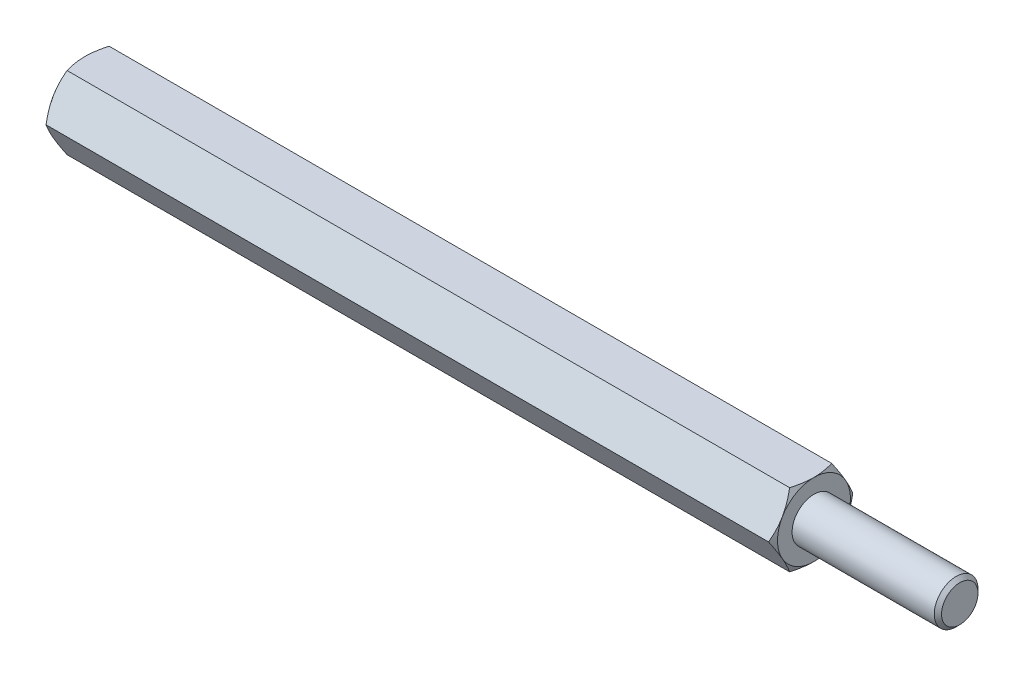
ISO-10303-21;
HEADER;
FILE_DESCRIPTION(('STEP AP214'),'2;1');
FILE_NAME('part.step','',(''),(''),'','','');
FILE_SCHEMA(('AUTOMOTIVE_DESIGN { 1 0 10303 214 1 1 1 1 }'));
ENDSEC;
DATA;
#1=APPLICATION_CONTEXT('core data for automotive mechanical design processes');
#2=APPLICATION_PROTOCOL_DEFINITION('international standard','automotive_design',2000,#1);
#3=PRODUCT_CONTEXT('',#1,'mechanical');
#4=PRODUCT('Part','Part','',(#3));
#5=PRODUCT_RELATED_PRODUCT_CATEGORY('part','',(#4));
#6=PRODUCT_DEFINITION_FORMATION('','',#4);
#7=PRODUCT_DEFINITION_CONTEXT('part definition',#1,'design');
#8=PRODUCT_DEFINITION('design','',#6,#7);
#9=PRODUCT_DEFINITION_SHAPE('','',#8);
#10=(LENGTH_UNIT() NAMED_UNIT(*) SI_UNIT(.MILLI.,.METRE.));
#11=(NAMED_UNIT(*) PLANE_ANGLE_UNIT() SI_UNIT($,.RADIAN.));
#12=(NAMED_UNIT(*) SI_UNIT($,.STERADIAN.) SOLID_ANGLE_UNIT());
#13=UNCERTAINTY_MEASURE_WITH_UNIT(LENGTH_MEASURE(1.E-05),#10,'distance_accuracy_value','');
#14=(GEOMETRIC_REPRESENTATION_CONTEXT(3) GLOBAL_UNCERTAINTY_ASSIGNED_CONTEXT((#13)) GLOBAL_UNIT_ASSIGNED_CONTEXT((#10,
#11,#12)) REPRESENTATION_CONTEXT('',''));
#15=CARTESIAN_POINT('',(0.,0.,0.));
#16=DIRECTION('',(0.,0.,1.));
#17=DIRECTION('',(1.,0.,0.));
#18=AXIS2_PLACEMENT_3D('',#15,#16,#17);
#19=CARTESIAN_POINT('',(25.,2.5,-1.44337567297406));
#20=DIRECTION('',(1.,0.,0.));
#21=DIRECTION('',(0.,0.,-1.));
#22=AXIS2_PLACEMENT_3D('',#19,#20,#21);
#23=PLANE('',#22);
#24=CARTESIAN_POINT('',(25.,0.,0.));
#25=DIRECTION('',(1.,0.,0.));
#26=DIRECTION('',(0.,0.,-1.));
#27=AXIS2_PLACEMENT_3D('',#24,#25,#26);
#28=CIRCLE('',#27,2.50000000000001);
#29=CARTESIAN_POINT('',(25.,-1.25,-2.16506350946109));
#30=VERTEX_POINT('',#29);
#31=CARTESIAN_POINT('',(25.,1.25,-2.1650635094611));
#32=VERTEX_POINT('',#31);
#33=EDGE_CURVE('E288',#30,#32,#28,.T.);
#34=ORIENTED_EDGE('',*,*,#33,.T.);
#35=CARTESIAN_POINT('',(25.,2.5,0.));
#36=VERTEX_POINT('',#35);
#37=EDGE_CURVE('E53',#32,#36,#28,.T.);
#38=ORIENTED_EDGE('',*,*,#37,.T.);
#39=CARTESIAN_POINT('',(25.,1.25,2.1650635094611));
#40=VERTEX_POINT('',#39);
#41=EDGE_CURVE('E296',#36,#40,#28,.T.);
#42=ORIENTED_EDGE('',*,*,#41,.T.);
#43=CARTESIAN_POINT('',(25.,-1.25000000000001,2.1650635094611));
#44=VERTEX_POINT('',#43);
#45=EDGE_CURVE('E301',#40,#44,#28,.T.);
#46=ORIENTED_EDGE('',*,*,#45,.T.);
#47=CARTESIAN_POINT('',(25.,0.,0.));
#48=DIRECTION('',(-1.,0.,0.));
#49=DIRECTION('',(0.,-1.,0.));
#50=AXIS2_PLACEMENT_3D('',#47,#48,#49);
#51=CIRCLE('',#50,2.50000000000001);
#52=CARTESIAN_POINT('',(25.,-2.50000000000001,0.));
#53=VERTEX_POINT('',#52);
#54=EDGE_CURVE('E193',#53,#44,#51,.T.);
#55=ORIENTED_EDGE('',*,*,#54,.F.);
#56=EDGE_CURVE('E61',#53,#30,#28,.T.);
#57=ORIENTED_EDGE('',*,*,#56,.T.);
#58=EDGE_LOOP('',(#34,#38,#42,#46,#55,#57));
#59=FACE_BOUND('',#58,.T.);
#60=CARTESIAN_POINT('',(25.,0.,0.));
#61=DIRECTION('',(1.,0.,0.));
#62=DIRECTION('',(0.,0.,-1.));
#63=AXIS2_PLACEMENT_3D('',#60,#61,#62);
#64=CIRCLE('',#63,1.5);
#65=CARTESIAN_POINT('',(25.,0.,-1.5));
#66=VERTEX_POINT('',#65);
#67=EDGE_CURVE('E311',#66,#66,#64,.T.);
#68=ORIENTED_EDGE('',*,*,#67,.F.);
#69=EDGE_LOOP('',(#68));
#70=FACE_BOUND('',#69,.T.);
#71=ADVANCED_FACE('F37',(#59,#70),#23,.T.);
#72=CARTESIAN_POINT('',(25.,0.,-2.88675134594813));
#73=DIRECTION('',(0.,-0.5,0.866025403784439));
#74=DIRECTION('',(0.,-0.866025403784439,-0.5));
#75=AXIS2_PLACEMENT_3D('',#72,#73,#74);
#76=PLANE('',#75);
#77=CARTESIAN_POINT('',(24.7766423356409,-0.0001999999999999,-2.88686681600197));
#78=CARTESIAN_POINT('',(24.8132783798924,0.109663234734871,-2.82343724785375));
#79=CARTESIAN_POINT('',(24.846597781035,0.220474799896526,-2.75946016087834));
#80=CARTESIAN_POINT('',(24.9047577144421,0.444016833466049,-2.63039810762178));
#81=CARTESIAN_POINT('',(24.9295776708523,0.556751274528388,-2.5653108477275));
#82=CARTESIAN_POINT('',(24.968214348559,0.780822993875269,-2.43594298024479));
#83=CARTESIAN_POINT('',(24.9822882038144,0.892125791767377,-2.37168227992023));
#84=CARTESIAN_POINT('',(24.9990908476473,1.11525522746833,-2.24285844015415));
#85=CARTESIAN_POINT('',(25.0018335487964,1.22708105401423,-2.17829576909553));
#86=CARTESIAN_POINT('',(24.9961342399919,1.43604197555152,-2.05765212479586));
#87=CARTESIAN_POINT('',(24.9890916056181,1.53320831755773,-2.0015531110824));
#88=CARTESIAN_POINT('',(24.9667685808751,1.726907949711,-1.88972057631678));
#89=CARTESIAN_POINT('',(24.9514805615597,1.82344056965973,-1.8339874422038));
#90=CARTESIAN_POINT('',(24.9132609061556,2.01753972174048,-1.7219242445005));
#91=CARTESIAN_POINT('',(24.8901672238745,2.11508168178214,-1.66560836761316));
#92=CARTESIAN_POINT('',(24.8377533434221,2.30871060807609,-1.55381665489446));
#93=CARTESIAN_POINT('',(24.8084454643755,2.40480005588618,-1.49833938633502));
#94=CARTESIAN_POINT('',(24.7766423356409,2.5002,-1.44326020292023));
#95=B_SPLINE_CURVE_WITH_KNOTS('',3,(#77,#78,#79,#80,#81,#82,#83,#84,#85,#86,#87,#88,#89,#90,#91,
#92,#93,#94),.UNSPECIFIED.,.F.,.F.,(4,2,2,2,2,2,2,2,4),(0.,0.396285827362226,0.793524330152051,
1.18093086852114,1.56786160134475,1.90479741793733,2.24204551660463,2.58677531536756,
2.93082800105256),.UNSPECIFIED.);
#96=CARTESIAN_POINT('',(24.7767090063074,0.,-2.88675134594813));
#97=VERTEX_POINT('',#96);
#98=EDGE_CURVE('E348',#97,#32,#95,.T.);
#99=ORIENTED_EDGE('',*,*,#98,.F.);
#100=DIRECTION('',(-1.,0.,0.));
#101=VECTOR('',#100,1.);
#102=CARTESIAN_POINT('',(25.,0.,-2.88675134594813));
#103=LINE('',#102,#101);
#104=CARTESIAN_POINT('',(-24.7767090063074,0.,-2.88675134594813));
#105=VERTEX_POINT('',#104);
#106=EDGE_CURVE('E264',#97,#105,#103,.T.);
#107=ORIENTED_EDGE('',*,*,#106,.T.);
#108=CARTESIAN_POINT('',(-24.7766423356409,2.5002,-1.44326020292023));
#109=CARTESIAN_POINT('',(-24.8132783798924,2.39033676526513,-1.50668977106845));
#110=CARTESIAN_POINT('',(-24.8465977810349,2.27952520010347,-1.57066685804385));
#111=CARTESIAN_POINT('',(-24.9047577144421,2.05598316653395,-1.69972891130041));
#112=CARTESIAN_POINT('',(-24.9295776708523,1.94324872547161,-1.7648161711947));
#113=CARTESIAN_POINT('',(-24.968214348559,1.71917700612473,-1.8941840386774));
#114=CARTESIAN_POINT('',(-24.9822882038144,1.60787420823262,-1.95844473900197));
#115=CARTESIAN_POINT('',(-24.9990908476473,1.38474477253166,-2.08726857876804));
#116=CARTESIAN_POINT('',(-25.0018335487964,1.27291894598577,-2.15183124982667));
#117=CARTESIAN_POINT('',(-24.9961342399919,1.06395802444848,-2.27247489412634));
#118=CARTESIAN_POINT('',(-24.9890916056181,0.966791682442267,-2.32857390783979));
#119=CARTESIAN_POINT('',(-24.9667685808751,0.773092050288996,-2.44040644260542));
#120=CARTESIAN_POINT('',(-24.9514805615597,0.676559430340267,-2.4961395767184));
#121=CARTESIAN_POINT('',(-24.9132609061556,0.482460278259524,-2.60820277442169));
#122=CARTESIAN_POINT('',(-24.8901672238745,0.38491831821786,-2.66451865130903));
#123=CARTESIAN_POINT('',(-24.8377533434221,0.191289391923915,-2.77631036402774));
#124=CARTESIAN_POINT('',(-24.8084454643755,0.095199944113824,-2.83178763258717));
#125=CARTESIAN_POINT('',(-24.7766423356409,-0.00020000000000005,-2.88686681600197));
#126=B_SPLINE_CURVE_WITH_KNOTS('',3,(#108,#109,#110,#111,#112,#113,#114,#115,#116,#117,#118,
#119,#120,#121,#122,#123,#124,#125),.UNSPECIFIED.,.F.,.F.,(4,2,2,2,2,2,2,2,4),(0.,
0.396285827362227,0.793524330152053,1.18093086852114,1.56786160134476,1.90479741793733,
2.24204551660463,2.58677531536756,2.93082800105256),.UNSPECIFIED.);
#127=CARTESIAN_POINT('',(-25.,1.25,-2.1650635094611));
#128=VERTEX_POINT('',#127);
#129=EDGE_CURVE('E339',#128,#105,#126,.T.);
#130=ORIENTED_EDGE('',*,*,#129,.F.);
#131=CARTESIAN_POINT('',(-24.7767090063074,2.5,-1.44337567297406));
#132=VERTEX_POINT('',#131);
#133=EDGE_CURVE('E391',#132,#128,#126,.T.);
#134=ORIENTED_EDGE('',*,*,#133,.F.);
#135=DIRECTION('',(-1.,0.,0.));
#136=VECTOR('',#135,1.);
#137=CARTESIAN_POINT('',(25.,2.5,-1.44337567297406));
#138=LINE('',#137,#136);
#139=CARTESIAN_POINT('',(24.7767090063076,2.5,-1.44337567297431));
#140=VERTEX_POINT('',#139);
#141=EDGE_CURVE('E279',#140,#132,#138,.T.);
#142=ORIENTED_EDGE('',*,*,#141,.F.);
#143=EDGE_CURVE('E229',#32,#140,#95,.T.);
#144=ORIENTED_EDGE('',*,*,#143,.F.);
#145=EDGE_LOOP('',(#99,#107,#130,#134,#142,#144));
#146=FACE_BOUND('',#145,.T.);
#147=ADVANCED_FACE('F148',(#146),#76,.F.);
#148=CARTESIAN_POINT('',(25.,2.5,-1.44337567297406));
#149=DIRECTION('',(0.,-1.,0.));
#150=DIRECTION('',(0.,0.,-1.));
#151=AXIS2_PLACEMENT_3D('',#148,#149,#150);
#152=PLANE('',#151);
#153=CARTESIAN_POINT('',(23.7680338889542,2.5,-3.90158441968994));
#154=CARTESIAN_POINT('',(23.8212077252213,2.5,-3.79217004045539));
#155=CARTESIAN_POINT('',(23.8738786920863,2.5,-3.68250707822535));
#156=CARTESIAN_POINT('',(23.9779324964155,2.5,-3.46255185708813));
#157=CARTESIAN_POINT('',(24.0293151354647,2.5,-3.35225950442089));
#158=CARTESIAN_POINT('',(24.1307630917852,2.5,-3.13035696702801));
#159=CARTESIAN_POINT('',(24.1808199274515,2.5,-3.0187428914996));
#160=CARTESIAN_POINT('',(24.2789171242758,2.5,-2.79463535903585));
#161=CARTESIAN_POINT('',(24.3269575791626,2.5,-2.68214194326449));
#162=CARTESIAN_POINT('',(24.4220184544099,2.5,-2.45240385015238));
#163=CARTESIAN_POINT('',(24.4689543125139,2.5,-2.33512399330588));
#164=CARTESIAN_POINT('',(24.5593326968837,2.5,-2.09920133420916));
#165=CARTESIAN_POINT('',(24.6027748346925,2.5,-1.98055838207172));
#166=CARTESIAN_POINT('',(24.6850435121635,2.5,-1.74193489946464));
#167=CARTESIAN_POINT('',(24.7238791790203,2.5,-1.62195754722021));
#168=CARTESIAN_POINT('',(24.7957050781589,2.5,-1.38028205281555));
#169=CARTESIAN_POINT('',(24.8286971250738,2.5,-1.25858445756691));
#170=CARTESIAN_POINT('',(24.8870959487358,2.5,-1.01406369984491));
#171=CARTESIAN_POINT('',(24.9125437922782,2.5,-0.891250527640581));
#172=CARTESIAN_POINT('',(24.9544275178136,2.5,-0.64407172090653));
#173=CARTESIAN_POINT('',(24.9708643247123,2.5,-0.519706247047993));
#174=CARTESIAN_POINT('',(24.9932006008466,2.5,-0.271679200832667));
#175=CARTESIAN_POINT('',(24.9992375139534,2.5,-0.148030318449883));
#176=CARTESIAN_POINT('',(25.0006256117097,2.5,0.0993395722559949));
#177=CARTESIAN_POINT('',(24.9959765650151,2.5,0.223060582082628));
#178=CARTESIAN_POINT('',(24.9794044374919,2.5,0.432351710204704));
#179=CARTESIAN_POINT('',(24.9701066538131,2.5,0.518143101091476));
#180=CARTESIAN_POINT('',(24.9469384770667,2.5,0.68911205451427));
#181=CARTESIAN_POINT('',(24.9330674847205,2.5,0.774289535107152));
#182=CARTESIAN_POINT('',(24.8853202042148,2.5,1.02876599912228));
#183=CARTESIAN_POINT('',(24.8453176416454,2.5,1.19691958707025));
#184=CARTESIAN_POINT('',(24.7522656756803,2.5,1.53362893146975));
#185=CARTESIAN_POINT('',(24.6989362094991,2.5,1.70210423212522));
#186=CARTESIAN_POINT('',(24.6123716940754,2.5,1.95247339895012));
#187=CARTESIAN_POINT('',(24.5824247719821,2.5,2.0355318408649));
#188=CARTESIAN_POINT('',(24.5206840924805,2.5,2.20095860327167));
#189=CARTESIAN_POINT('',(24.4888903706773,2.5,2.28332693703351));
#190=CARTESIAN_POINT('',(24.404014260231,2.5,2.49723312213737));
#191=CARTESIAN_POINT('',(24.3497173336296,2.5,2.62828796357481));
#192=CARTESIAN_POINT('',(24.2381273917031,2.5,2.88912034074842));
#193=CARTESIAN_POINT('',(24.1808341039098,2.5,3.01889775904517));
#194=CARTESIAN_POINT('',(24.0639348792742,2.5,3.27745045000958));
#195=CARTESIAN_POINT('',(24.004328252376,2.5,3.40622540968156));
#196=CARTESIAN_POINT('',(23.8833234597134,2.5,3.66293235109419));
#197=CARTESIAN_POINT('',(23.821925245,2.5,3.7908643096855));
#198=CARTESIAN_POINT('',(23.6354580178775,2.5,4.17399495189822));
#199=CARTESIAN_POINT('',(23.5082824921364,2.5,4.42816724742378));
#200=CARTESIAN_POINT('',(23.2503455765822,2.5,4.93461464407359));
#201=CARTESIAN_POINT('',(23.1195848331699,2.5,5.1868900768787));
#202=CARTESIAN_POINT('',(22.8687100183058,2.5,5.66512451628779));
#203=CARTESIAN_POINT('',(22.7488298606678,2.5,5.89120644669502));
#204=CARTESIAN_POINT('',(22.5075902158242,2.5,6.34259369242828));
#205=CARTESIAN_POINT('',(22.3862306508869,2.5,6.56789896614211));
#206=CARTESIAN_POINT('',(22.142780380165,2.5,7.01722044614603));
#207=CARTESIAN_POINT('',(22.0206930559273,2.5,7.24123848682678));
#208=CARTESIAN_POINT('',(21.7756662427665,2.5,7.68878772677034));
#209=CARTESIAN_POINT('',(21.652726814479,2.5,7.91231895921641));
#210=CARTESIAN_POINT('',(21.5294756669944,2.5,8.13567697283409));
#211=B_SPLINE_CURVE_WITH_KNOTS('',3,(#153,#154,#155,#156,#157,#158,#159,#160,#161,#162,#163,
#164,#165,#166,#167,#168,#169,#170,#171,#172,#173,#174,#175,#176,#177,#178,#179,#180,#181,#182,
#183,#184,#185,#186,#187,#188,#189,#190,#191,#192,#193,#194,#195,#196,#197,#198,#199,#200,#201,
#202,#203,#204,#205,#206,#207,#208,#209,#210),.UNSPECIFIED.,.F.,.F.,(4,2,2,2,2,2,2,2,2,2,2,2,2,
2,2,2,2,2,2,2,2,2,2,2,2,2,2,2,4),(0.,0.364957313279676,0.729970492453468,1.09692930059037,
1.46387103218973,1.84279746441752,2.22176597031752,2.59997058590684,2.97805755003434,
3.3540469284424,3.72999770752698,4.10094071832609,4.47189175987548,4.73064905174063,
4.98944026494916,5.50729076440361,6.037104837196,6.30196454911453,6.56681915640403,
6.99233818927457,7.41789598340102,7.84358170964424,8.26927907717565,9.12186602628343,
9.97430025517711,10.7419897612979,11.5097197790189,12.2750964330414,13.0404191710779),.UNSPECIFIED.);
#212=EDGE_CURVE('E227',#140,#36,#211,.T.);
#213=ORIENTED_EDGE('',*,*,#212,.F.);
#214=ORIENTED_EDGE('',*,*,#141,.T.);
#215=CARTESIAN_POINT('',(-23.7680338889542,2.5,-3.90158441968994));
#216=CARTESIAN_POINT('',(-23.8212077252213,2.5,-3.79217004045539));
#217=CARTESIAN_POINT('',(-23.8738786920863,2.5,-3.68250707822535));
#218=CARTESIAN_POINT('',(-23.9779324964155,2.5,-3.46255185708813));
#219=CARTESIAN_POINT('',(-24.0293151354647,2.5,-3.35225950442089));
#220=CARTESIAN_POINT('',(-24.1307630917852,2.5,-3.13035696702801));
#221=CARTESIAN_POINT('',(-24.1808199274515,2.5,-3.0187428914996));
#222=CARTESIAN_POINT('',(-24.2789171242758,2.5,-2.79463535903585));
#223=CARTESIAN_POINT('',(-24.3269575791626,2.5,-2.68214194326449));
#224=CARTESIAN_POINT('',(-24.4220184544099,2.5,-2.45240385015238));
#225=CARTESIAN_POINT('',(-24.4689543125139,2.5,-2.33512399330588));
#226=CARTESIAN_POINT('',(-24.5593326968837,2.5,-2.09920133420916));
#227=CARTESIAN_POINT('',(-24.6027748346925,2.5,-1.98055838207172));
#228=CARTESIAN_POINT('',(-24.6850435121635,2.5,-1.74193489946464));
#229=CARTESIAN_POINT('',(-24.7238791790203,2.5,-1.62195754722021));
#230=CARTESIAN_POINT('',(-24.7957050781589,2.5,-1.38028205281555));
#231=CARTESIAN_POINT('',(-24.8286971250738,2.5,-1.25858445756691));
#232=CARTESIAN_POINT('',(-24.8870959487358,2.5,-1.01406369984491));
#233=CARTESIAN_POINT('',(-24.9125437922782,2.5,-0.891250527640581));
#234=CARTESIAN_POINT('',(-24.9544275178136,2.5,-0.64407172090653));
#235=CARTESIAN_POINT('',(-24.9708643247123,2.5,-0.519706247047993));
#236=CARTESIAN_POINT('',(-24.9932006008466,2.5,-0.271679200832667));
#237=CARTESIAN_POINT('',(-24.9992375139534,2.5,-0.148030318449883));
#238=CARTESIAN_POINT('',(-25.0006256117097,2.5,0.0993395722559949));
#239=CARTESIAN_POINT('',(-24.9959765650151,2.5,0.223060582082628));
#240=CARTESIAN_POINT('',(-24.9794044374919,2.5,0.432351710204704));
#241=CARTESIAN_POINT('',(-24.9701066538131,2.5,0.518143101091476));
#242=CARTESIAN_POINT('',(-24.9469384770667,2.5,0.68911205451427));
#243=CARTESIAN_POINT('',(-24.9330674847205,2.5,0.774289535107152));
#244=CARTESIAN_POINT('',(-24.8853202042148,2.5,1.02876599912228));
#245=CARTESIAN_POINT('',(-24.8453176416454,2.5,1.19691958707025));
#246=CARTESIAN_POINT('',(-24.7522656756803,2.5,1.53362893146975));
#247=CARTESIAN_POINT('',(-24.6989362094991,2.5,1.70210423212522));
#248=CARTESIAN_POINT('',(-24.6123716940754,2.5,1.95247339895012));
#249=CARTESIAN_POINT('',(-24.5824247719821,2.5,2.0355318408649));
#250=CARTESIAN_POINT('',(-24.5206840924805,2.5,2.20095860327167));
#251=CARTESIAN_POINT('',(-24.4888903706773,2.5,2.28332693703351));
#252=CARTESIAN_POINT('',(-24.404014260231,2.5,2.49723312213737));
#253=CARTESIAN_POINT('',(-24.3497173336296,2.5,2.62828796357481));
#254=CARTESIAN_POINT('',(-24.2381273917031,2.5,2.88912034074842));
#255=CARTESIAN_POINT('',(-24.1808341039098,2.5,3.01889775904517));
#256=CARTESIAN_POINT('',(-24.0639348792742,2.5,3.27745045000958));
#257=CARTESIAN_POINT('',(-24.004328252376,2.5,3.40622540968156));
#258=CARTESIAN_POINT('',(-23.8833234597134,2.5,3.66293235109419));
#259=CARTESIAN_POINT('',(-23.821925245,2.5,3.7908643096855));
#260=CARTESIAN_POINT('',(-23.6354580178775,2.5,4.17399495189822));
#261=CARTESIAN_POINT('',(-23.5082824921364,2.5,4.42816724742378));
#262=CARTESIAN_POINT('',(-23.2503455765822,2.5,4.93461464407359));
#263=CARTESIAN_POINT('',(-23.1195848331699,2.5,5.1868900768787));
#264=CARTESIAN_POINT('',(-22.8687100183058,2.5,5.66512451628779));
#265=CARTESIAN_POINT('',(-22.7488298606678,2.5,5.89120644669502));
#266=CARTESIAN_POINT('',(-22.5075902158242,2.5,6.34259369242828));
#267=CARTESIAN_POINT('',(-22.3862306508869,2.5,6.56789896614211));
#268=CARTESIAN_POINT('',(-22.142780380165,2.5,7.01722044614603));
#269=CARTESIAN_POINT('',(-22.0206930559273,2.5,7.24123848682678));
#270=CARTESIAN_POINT('',(-21.7756662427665,2.5,7.68878772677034));
#271=CARTESIAN_POINT('',(-21.652726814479,2.5,7.91231895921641));
#272=CARTESIAN_POINT('',(-21.5294756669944,2.5,8.13567697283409));
#273=B_SPLINE_CURVE_WITH_KNOTS('',3,(#215,#216,#217,#218,#219,#220,#221,#222,#223,#224,#225,
#226,#227,#228,#229,#230,#231,#232,#233,#234,#235,#236,#237,#238,#239,#240,#241,#242,#243,#244,
#245,#246,#247,#248,#249,#250,#251,#252,#253,#254,#255,#256,#257,#258,#259,#260,#261,#262,#263,
#264,#265,#266,#267,#268,#269,#270,#271,#272),.UNSPECIFIED.,.F.,.F.,(4,2,2,2,2,2,2,2,2,2,2,2,2,
2,2,2,2,2,2,2,2,2,2,2,2,2,2,2,4),(0.,0.364957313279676,0.729970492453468,1.09692930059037,
1.46387103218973,1.84279746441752,2.22176597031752,2.59997058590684,2.97805755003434,
3.3540469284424,3.72999770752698,4.10094071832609,4.47189175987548,4.73064905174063,
4.98944026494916,5.50729076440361,6.037104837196,6.30196454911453,6.56681915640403,
6.99233818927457,7.41789598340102,7.84358170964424,8.26927907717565,9.12186602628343,
9.97430025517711,10.7419897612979,11.5097197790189,12.2750964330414,13.0404191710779),.UNSPECIFIED.);
#274=CARTESIAN_POINT('',(-25.,2.5,0.));
#275=VERTEX_POINT('',#274);
#276=EDGE_CURVE('E241',#275,#132,#273,.F.);
#277=ORIENTED_EDGE('',*,*,#276,.F.);
#278=CARTESIAN_POINT('',(-24.7767090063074,2.5,1.44337567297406));
#279=VERTEX_POINT('',#278);
#280=EDGE_CURVE('E249',#279,#275,#273,.F.);
#281=ORIENTED_EDGE('',*,*,#280,.F.);
#282=DIRECTION('',(-1.,0.,0.));
#283=VECTOR('',#282,1.);
#284=CARTESIAN_POINT('',(25.,2.5,1.44337567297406));
#285=LINE('',#284,#283);
#286=CARTESIAN_POINT('',(24.7767090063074,2.5,1.44337567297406));
#287=VERTEX_POINT('',#286);
#288=EDGE_CURVE('E276',#287,#279,#285,.T.);
#289=ORIENTED_EDGE('',*,*,#288,.F.);
#290=EDGE_CURVE('E221',#36,#287,#211,.T.);
#291=ORIENTED_EDGE('',*,*,#290,.F.);
#292=EDGE_LOOP('',(#213,#214,#277,#281,#289,#291));
#293=FACE_BOUND('',#292,.T.);
#294=ADVANCED_FACE('F153',(#293),#152,.F.);
#295=CARTESIAN_POINT('',(25.,2.5,1.44337567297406));
#296=DIRECTION('',(0.,-0.5,-0.866025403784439));
#297=DIRECTION('',(0.,0.866025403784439,-0.5));
#298=AXIS2_PLACEMENT_3D('',#295,#296,#297);
#299=PLANE('',#298);
#300=CARTESIAN_POINT('',(24.7766423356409,2.5002,1.44326020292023));
#301=CARTESIAN_POINT('',(24.8132783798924,2.39033676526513,1.50668977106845));
#302=CARTESIAN_POINT('',(24.8465977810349,2.27952520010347,1.57066685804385));
#303=CARTESIAN_POINT('',(24.9047577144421,2.05598316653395,1.69972891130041));
#304=CARTESIAN_POINT('',(24.9295776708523,1.94324872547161,1.7648161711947));
#305=CARTESIAN_POINT('',(24.968214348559,1.71917700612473,1.8941840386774));
#306=CARTESIAN_POINT('',(24.9822882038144,1.60787420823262,1.95844473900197));
#307=CARTESIAN_POINT('',(24.9990908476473,1.38474477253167,2.08726857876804));
#308=CARTESIAN_POINT('',(25.0018335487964,1.27291894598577,2.15183124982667));
#309=CARTESIAN_POINT('',(24.9961342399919,1.06395802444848,2.27247489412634));
#310=CARTESIAN_POINT('',(24.9890916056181,0.966791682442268,2.32857390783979));
#311=CARTESIAN_POINT('',(24.9667685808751,0.773092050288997,2.44040644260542));
#312=CARTESIAN_POINT('',(24.9514805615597,0.676559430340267,2.4961395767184));
#313=CARTESIAN_POINT('',(24.9132609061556,0.482460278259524,2.60820277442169));
#314=CARTESIAN_POINT('',(24.8901672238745,0.38491831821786,2.66451865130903));
#315=CARTESIAN_POINT('',(24.8377533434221,0.191289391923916,2.77631036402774));
#316=CARTESIAN_POINT('',(24.8084454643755,0.0951999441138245,2.83178763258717));
#317=CARTESIAN_POINT('',(24.7766423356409,-0.00019999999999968,2.88686681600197));
#318=B_SPLINE_CURVE_WITH_KNOTS('',3,(#300,#301,#302,#303,#304,#305,#306,#307,#308,#309,#310,
#311,#312,#313,#314,#315,#316,#317),.UNSPECIFIED.,.F.,.F.,(4,2,2,2,2,2,2,2,4),(0.,
0.396285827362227,0.793524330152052,1.18093086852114,1.56786160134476,1.90479741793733,
2.24204551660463,2.58677531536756,2.93082800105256),.UNSPECIFIED.);
#319=EDGE_CURVE('E228',#287,#40,#318,.T.);
#320=ORIENTED_EDGE('',*,*,#319,.F.);
#321=ORIENTED_EDGE('',*,*,#288,.T.);
#322=CARTESIAN_POINT('',(-24.7766423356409,-0.000199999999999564,2.88686681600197));
#323=CARTESIAN_POINT('',(-24.8132783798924,0.109663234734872,2.82343724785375));
#324=CARTESIAN_POINT('',(-24.846597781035,0.220474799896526,2.75946016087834));
#325=CARTESIAN_POINT('',(-24.9047577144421,0.44401683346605,2.63039810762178));
#326=CARTESIAN_POINT('',(-24.9295776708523,0.556751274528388,2.5653108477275));
#327=CARTESIAN_POINT('',(-24.968214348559,0.780822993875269,2.43594298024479));
#328=CARTESIAN_POINT('',(-24.9822882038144,0.892125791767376,2.37168227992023));
#329=CARTESIAN_POINT('',(-24.9990908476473,1.11525522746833,2.24285844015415));
#330=CARTESIAN_POINT('',(-25.0018335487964,1.22708105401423,2.17829576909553));
#331=CARTESIAN_POINT('',(-24.9961342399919,1.43604197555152,2.05765212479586));
#332=CARTESIAN_POINT('',(-24.9890916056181,1.53320831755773,2.0015531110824));
#333=CARTESIAN_POINT('',(-24.9667685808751,1.726907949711,1.88972057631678));
#334=CARTESIAN_POINT('',(-24.9514805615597,1.82344056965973,1.8339874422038));
#335=CARTESIAN_POINT('',(-24.9132609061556,2.01753972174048,1.7219242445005));
#336=CARTESIAN_POINT('',(-24.8901672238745,2.11508168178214,1.66560836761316));
#337=CARTESIAN_POINT('',(-24.8377533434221,2.30871060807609,1.55381665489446));
#338=CARTESIAN_POINT('',(-24.8084454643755,2.40480005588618,1.49833938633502));
#339=CARTESIAN_POINT('',(-24.7766423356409,2.5002,1.44326020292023));
#340=B_SPLINE_CURVE_WITH_KNOTS('',3,(#322,#323,#324,#325,#326,#327,#328,#329,#330,#331,#332,
#333,#334,#335,#336,#337,#338,#339),.UNSPECIFIED.,.F.,.F.,(4,2,2,2,2,2,2,2,4),(0.,
0.396285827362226,0.79352433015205,1.18093086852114,1.56786160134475,1.90479741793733,
2.24204551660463,2.58677531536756,2.93082800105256),.UNSPECIFIED.);
#341=CARTESIAN_POINT('',(-25.,1.25,2.1650635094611));
#342=VERTEX_POINT('',#341);
#343=EDGE_CURVE('E255',#342,#279,#340,.T.);
#344=ORIENTED_EDGE('',*,*,#343,.F.);
#345=CARTESIAN_POINT('',(-24.7767090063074,0.,2.88675134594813));
#346=VERTEX_POINT('',#345);
#347=EDGE_CURVE('E262',#346,#342,#340,.T.);
#348=ORIENTED_EDGE('',*,*,#347,.F.);
#349=DIRECTION('',(-1.,0.,0.));
#350=VECTOR('',#349,1.);
#351=CARTESIAN_POINT('',(25.,0.,2.88675134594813));
#352=LINE('',#351,#350);
#353=CARTESIAN_POINT('',(24.7767090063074,0.,2.88675134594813));
#354=VERTEX_POINT('',#353);
#355=EDGE_CURVE('E273',#354,#346,#352,.T.);
#356=ORIENTED_EDGE('',*,*,#355,.F.);
#357=EDGE_CURVE('E215',#40,#354,#318,.T.);
#358=ORIENTED_EDGE('',*,*,#357,.F.);
#359=EDGE_LOOP('',(#320,#321,#344,#348,#356,#358));
#360=FACE_BOUND('',#359,.T.);
#361=ADVANCED_FACE('F235',(#360),#299,.F.);
#362=CARTESIAN_POINT('',(25.,0.,2.88675134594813));
#363=DIRECTION('',(0.,0.5,-0.866025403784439));
#364=DIRECTION('',(0.,0.866025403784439,0.5));
#365=AXIS2_PLACEMENT_3D('',#362,#363,#364);
#366=PLANE('',#365);
#367=CARTESIAN_POINT('',(24.7766423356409,0.000200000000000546,2.88686681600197));
#368=CARTESIAN_POINT('',(24.8132783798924,-0.109663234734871,2.82343724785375));
#369=CARTESIAN_POINT('',(24.846597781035,-0.220474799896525,2.75946016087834));
#370=CARTESIAN_POINT('',(24.9047577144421,-0.444016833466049,2.63039810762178));
#371=CARTESIAN_POINT('',(24.9295776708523,-0.556751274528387,2.5653108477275));
#372=CARTESIAN_POINT('',(24.968214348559,-0.780822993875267,2.43594298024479));
#373=CARTESIAN_POINT('',(24.9822882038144,-0.892125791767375,2.37168227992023));
#374=CARTESIAN_POINT('',(24.9990908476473,-1.11525522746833,2.24285844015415));
#375=CARTESIAN_POINT('',(25.0018335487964,-1.22708105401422,2.17829576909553));
#376=CARTESIAN_POINT('',(24.996134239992,-1.43604197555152,2.05765212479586));
#377=CARTESIAN_POINT('',(24.9890916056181,-1.53320831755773,2.0015531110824));
#378=CARTESIAN_POINT('',(24.9667685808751,-1.726907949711,1.88972057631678));
#379=CARTESIAN_POINT('',(24.9514805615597,-1.82344056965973,1.8339874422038));
#380=CARTESIAN_POINT('',(24.9132609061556,-2.01753972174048,1.7219242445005));
#381=CARTESIAN_POINT('',(24.8901672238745,-2.11508168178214,1.66560836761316));
#382=CARTESIAN_POINT('',(24.8377533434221,-2.30871060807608,1.55381665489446));
#383=CARTESIAN_POINT('',(24.8084454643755,-2.40480005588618,1.49833938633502));
#384=CARTESIAN_POINT('',(24.7766423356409,-2.5002,1.44326020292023));
#385=B_SPLINE_CURVE_WITH_KNOTS('',3,(#367,#368,#369,#370,#371,#372,#373,#374,#375,#376,#377,
#378,#379,#380,#381,#382,#383,#384),.UNSPECIFIED.,.F.,.F.,(4,2,2,2,2,2,2,2,4),(0.,
0.396285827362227,0.79352433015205,1.18093086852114,1.56786160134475,1.90479741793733,
2.24204551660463,2.58677531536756,2.93082800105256),.UNSPECIFIED.);
#386=EDGE_CURVE('E370',#354,#44,#385,.T.);
#387=ORIENTED_EDGE('',*,*,#386,.F.);
#388=ORIENTED_EDGE('',*,*,#355,.T.);
#389=CARTESIAN_POINT('',(-24.7766423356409,-2.5002,1.44326020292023));
#390=CARTESIAN_POINT('',(-24.8132783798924,-2.39033676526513,1.50668977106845));
#391=CARTESIAN_POINT('',(-24.846597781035,-2.27952520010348,1.57066685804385));
#392=CARTESIAN_POINT('',(-24.9047577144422,-2.05598316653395,1.69972891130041));
#393=CARTESIAN_POINT('',(-24.9295776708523,-1.94324872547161,1.76481617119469));
#394=CARTESIAN_POINT('',(-24.968214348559,-1.71917700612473,1.8941840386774));
#395=CARTESIAN_POINT('',(-24.9822882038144,-1.60787420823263,1.95844473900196));
#396=CARTESIAN_POINT('',(-24.9990908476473,-1.38474477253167,2.08726857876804));
#397=CARTESIAN_POINT('',(-25.0018335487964,-1.27291894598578,2.15183124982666));
#398=CARTESIAN_POINT('',(-24.996134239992,-1.06395802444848,2.27247489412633));
#399=CARTESIAN_POINT('',(-24.9890916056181,-0.966791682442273,2.32857390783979));
#400=CARTESIAN_POINT('',(-24.9667685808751,-0.773092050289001,2.44040644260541));
#401=CARTESIAN_POINT('',(-24.9514805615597,-0.67655943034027,2.49613957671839));
#402=CARTESIAN_POINT('',(-24.9132609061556,-0.482460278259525,2.60820277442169));
#403=CARTESIAN_POINT('',(-24.8901672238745,-0.38491831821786,2.66451865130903));
#404=CARTESIAN_POINT('',(-24.8377533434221,-0.191289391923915,2.77631036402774));
#405=CARTESIAN_POINT('',(-24.8084454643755,-0.0951999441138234,2.83178763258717));
#406=CARTESIAN_POINT('',(-24.7766423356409,0.000200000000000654,2.88686681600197));
#407=B_SPLINE_CURVE_WITH_KNOTS('',3,(#389,#390,#391,#392,#393,#394,#395,#396,#397,#398,#399,
#400,#401,#402,#403,#404,#405,#406),.UNSPECIFIED.,.F.,.F.,(4,2,2,2,2,2,2,2,4),(0.,
0.396285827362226,0.793524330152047,1.18093086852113,1.56786160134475,1.90479741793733,
2.24204551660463,2.58677531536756,2.93082800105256),.UNSPECIFIED.);
#408=CARTESIAN_POINT('',(-25.,-1.25000000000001,2.1650635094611));
#409=VERTEX_POINT('',#408);
#410=EDGE_CURVE('E263',#409,#346,#407,.T.);
#411=ORIENTED_EDGE('',*,*,#410,.F.);
#412=CARTESIAN_POINT('',(-24.7767090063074,-2.5,1.44337567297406));
#413=VERTEX_POINT('',#412);
#414=EDGE_CURVE('E250',#413,#409,#407,.T.);
#415=ORIENTED_EDGE('',*,*,#414,.F.);
#416=DIRECTION('',(-1.,0.,0.));
#417=VECTOR('',#416,1.);
#418=CARTESIAN_POINT('',(25.,-2.5,1.44337567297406));
#419=LINE('',#418,#417);
#420=CARTESIAN_POINT('',(24.7767090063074,-2.5,1.44337567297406));
#421=VERTEX_POINT('',#420);
#422=EDGE_CURVE('E270',#421,#413,#419,.T.);
#423=ORIENTED_EDGE('',*,*,#422,.F.);
#424=EDGE_CURVE('E210',#44,#421,#385,.T.);
#425=ORIENTED_EDGE('',*,*,#424,.F.);
#426=EDGE_LOOP('',(#387,#388,#411,#415,#423,#425));
#427=FACE_BOUND('',#426,.T.);
#428=ADVANCED_FACE('F442',(#427),#366,.F.);
#429=CARTESIAN_POINT('',(25.,-2.5,1.44337567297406));
#430=DIRECTION('',(0.,1.,0.));
#431=DIRECTION('',(0.,0.,1.));
#432=AXIS2_PLACEMENT_3D('',#429,#430,#431);
#433=PLANE('',#432);
#434=CARTESIAN_POINT('',(23.7680338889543,-2.5,-3.90158441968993));
#435=CARTESIAN_POINT('',(23.8212077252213,-2.5,-3.79217004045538));
#436=CARTESIAN_POINT('',(23.8738786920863,-2.5,-3.68250707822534));
#437=CARTESIAN_POINT('',(23.9779324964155,-2.5,-3.46255185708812));
#438=CARTESIAN_POINT('',(24.0293151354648,-2.5,-3.35225950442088));
#439=CARTESIAN_POINT('',(24.1307630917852,-2.5,-3.130356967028));
#440=CARTESIAN_POINT('',(24.1808199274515,-2.5,-3.01874289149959));
#441=CARTESIAN_POINT('',(24.2789171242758,-2.5,-2.79463535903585));
#442=CARTESIAN_POINT('',(24.3269575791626,-2.5,-2.68214194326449));
#443=CARTESIAN_POINT('',(24.4220184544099,-2.5,-2.45240385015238));
#444=CARTESIAN_POINT('',(24.4689543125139,-2.5,-2.33512399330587));
#445=CARTESIAN_POINT('',(24.5593326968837,-2.5,-2.09920133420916));
#446=CARTESIAN_POINT('',(24.6027748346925,-2.5,-1.98055838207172));
#447=CARTESIAN_POINT('',(24.6850435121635,-2.5,-1.74193489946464));
#448=CARTESIAN_POINT('',(24.7238791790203,-2.5,-1.6219575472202));
#449=CARTESIAN_POINT('',(24.7957050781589,-2.5,-1.38028205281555));
#450=CARTESIAN_POINT('',(24.8286971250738,-2.5,-1.25858445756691));
#451=CARTESIAN_POINT('',(24.8870959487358,-2.5,-1.01406369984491));
#452=CARTESIAN_POINT('',(24.9125437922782,-2.5,-0.891250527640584));
#453=CARTESIAN_POINT('',(24.9544275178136,-2.5,-0.644071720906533));
#454=CARTESIAN_POINT('',(24.9708643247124,-2.5,-0.519706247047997));
#455=CARTESIAN_POINT('',(24.9932006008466,-2.5,-0.271679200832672));
#456=CARTESIAN_POINT('',(24.9992375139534,-2.5,-0.148030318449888));
#457=CARTESIAN_POINT('',(25.0006256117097,-2.5,0.0993395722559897));
#458=CARTESIAN_POINT('',(24.9959765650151,-2.5,0.223060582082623));
#459=CARTESIAN_POINT('',(24.979404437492,-2.5,0.432351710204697));
#460=CARTESIAN_POINT('',(24.9701066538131,-2.5,0.518143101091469));
#461=CARTESIAN_POINT('',(24.9469384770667,-2.5,0.689112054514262));
#462=CARTESIAN_POINT('',(24.9330674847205,-2.5,0.774289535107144));
#463=CARTESIAN_POINT('',(24.8853202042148,-2.5,1.02876599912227));
#464=CARTESIAN_POINT('',(24.8453176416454,-2.5,1.19691958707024));
#465=CARTESIAN_POINT('',(24.7522656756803,-2.5,1.53362893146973));
#466=CARTESIAN_POINT('',(24.6989362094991,-2.5,1.70210423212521));
#467=CARTESIAN_POINT('',(24.6123716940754,-2.5,1.9524733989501));
#468=CARTESIAN_POINT('',(24.5824247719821,-2.5,2.03553184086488));
#469=CARTESIAN_POINT('',(24.5206840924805,-2.5,2.20095860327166));
#470=CARTESIAN_POINT('',(24.4888903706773,-2.5,2.28332693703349));
#471=CARTESIAN_POINT('',(24.404014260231,-2.5,2.49723312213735));
#472=CARTESIAN_POINT('',(24.3497173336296,-2.5,2.62828796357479));
#473=CARTESIAN_POINT('',(24.2381273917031,-2.5,2.8891203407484));
#474=CARTESIAN_POINT('',(24.1808341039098,-2.5,3.01889775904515));
#475=CARTESIAN_POINT('',(24.0639348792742,-2.5,3.27745045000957));
#476=CARTESIAN_POINT('',(24.004328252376,-2.5,3.40622540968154));
#477=CARTESIAN_POINT('',(23.8833234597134,-2.5,3.66293235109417));
#478=CARTESIAN_POINT('',(23.821925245,-2.5,3.79086430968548));
#479=CARTESIAN_POINT('',(23.6354580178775,-2.5,4.1739949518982));
#480=CARTESIAN_POINT('',(23.5082824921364,-2.5,4.42816724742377));
#481=CARTESIAN_POINT('',(23.2503455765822,-2.5,4.93461464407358));
#482=CARTESIAN_POINT('',(23.1195848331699,-2.5,5.18689007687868));
#483=CARTESIAN_POINT('',(22.8687100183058,-2.5,5.66512451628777));
#484=CARTESIAN_POINT('',(22.7488298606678,-2.5,5.891206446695));
#485=CARTESIAN_POINT('',(22.5075902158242,-2.5,6.34259369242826));
#486=CARTESIAN_POINT('',(22.3862306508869,-2.5,6.5678989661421));
#487=CARTESIAN_POINT('',(22.142780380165,-2.5,7.01722044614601));
#488=CARTESIAN_POINT('',(22.0206930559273,-2.5,7.24123848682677));
#489=CARTESIAN_POINT('',(21.7756662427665,-2.5,7.68878772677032));
#490=CARTESIAN_POINT('',(21.652726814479,-2.5,7.91231895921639));
#491=CARTESIAN_POINT('',(21.5294756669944,-2.5,8.13567697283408));
#492=B_SPLINE_CURVE_WITH_KNOTS('',3,(#434,#435,#436,#437,#438,#439,#440,#441,#442,#443,#444,
#445,#446,#447,#448,#449,#450,#451,#452,#453,#454,#455,#456,#457,#458,#459,#460,#461,#462,#463,
#464,#465,#466,#467,#468,#469,#470,#471,#472,#473,#474,#475,#476,#477,#478,#479,#480,#481,#482,
#483,#484,#485,#486,#487,#488,#489,#490,#491),.UNSPECIFIED.,.F.,.F.,(4,2,2,2,2,2,2,2,2,2,2,2,2,
2,2,2,2,2,2,2,2,2,2,2,2,2,2,2,4),(0.,0.364957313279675,0.729970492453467,1.09692930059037,
1.46387103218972,1.84279746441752,2.22176597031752,2.59997058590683,2.97805755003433,
3.35404692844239,3.72999770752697,4.10094071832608,4.47189175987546,4.73064905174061,
4.98944026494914,5.50729076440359,6.03710483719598,6.30196454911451,6.566819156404,
6.99233818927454,7.417895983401,7.84358170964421,8.26927907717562,9.1218660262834,
9.97430025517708,10.7419897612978,11.5097197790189,12.2750964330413,13.0404191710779),.UNSPECIFIED.);
#493=EDGE_CURVE('E377',#421,#53,#492,.F.);
#494=ORIENTED_EDGE('',*,*,#493,.F.);
#495=ORIENTED_EDGE('',*,*,#422,.T.);
#496=CARTESIAN_POINT('',(-23.7680338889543,-2.5,-3.90158441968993));
#497=CARTESIAN_POINT('',(-23.8212077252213,-2.5,-3.79217004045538));
#498=CARTESIAN_POINT('',(-23.8738786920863,-2.5,-3.68250707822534));
#499=CARTESIAN_POINT('',(-23.9779324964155,-2.5,-3.46255185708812));
#500=CARTESIAN_POINT('',(-24.0293151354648,-2.5,-3.35225950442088));
#501=CARTESIAN_POINT('',(-24.1307630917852,-2.5,-3.130356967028));
#502=CARTESIAN_POINT('',(-24.1808199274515,-2.5,-3.01874289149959));
#503=CARTESIAN_POINT('',(-24.2789171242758,-2.5,-2.79463535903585));
#504=CARTESIAN_POINT('',(-24.3269575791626,-2.5,-2.68214194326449));
#505=CARTESIAN_POINT('',(-24.4220184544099,-2.5,-2.45240385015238));
#506=CARTESIAN_POINT('',(-24.4689543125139,-2.5,-2.33512399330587));
#507=CARTESIAN_POINT('',(-24.5593326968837,-2.5,-2.09920133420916));
#508=CARTESIAN_POINT('',(-24.6027748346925,-2.5,-1.98055838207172));
#509=CARTESIAN_POINT('',(-24.6850435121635,-2.5,-1.74193489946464));
#510=CARTESIAN_POINT('',(-24.7238791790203,-2.5,-1.6219575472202));
#511=CARTESIAN_POINT('',(-24.7957050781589,-2.5,-1.38028205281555));
#512=CARTESIAN_POINT('',(-24.8286971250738,-2.5,-1.25858445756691));
#513=CARTESIAN_POINT('',(-24.8870959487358,-2.5,-1.01406369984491));
#514=CARTESIAN_POINT('',(-24.9125437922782,-2.5,-0.891250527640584));
#515=CARTESIAN_POINT('',(-24.9544275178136,-2.5,-0.644071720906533));
#516=CARTESIAN_POINT('',(-24.9708643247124,-2.5,-0.519706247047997));
#517=CARTESIAN_POINT('',(-24.9932006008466,-2.5,-0.271679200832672));
#518=CARTESIAN_POINT('',(-24.9992375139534,-2.5,-0.148030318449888));
#519=CARTESIAN_POINT('',(-25.0006256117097,-2.5,0.0993395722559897));
#520=CARTESIAN_POINT('',(-24.9959765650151,-2.5,0.223060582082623));
#521=CARTESIAN_POINT('',(-24.979404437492,-2.5,0.432351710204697));
#522=CARTESIAN_POINT('',(-24.9701066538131,-2.5,0.518143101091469));
#523=CARTESIAN_POINT('',(-24.9469384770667,-2.5,0.689112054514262));
#524=CARTESIAN_POINT('',(-24.9330674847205,-2.5,0.774289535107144));
#525=CARTESIAN_POINT('',(-24.8853202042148,-2.5,1.02876599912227));
#526=CARTESIAN_POINT('',(-24.8453176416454,-2.5,1.19691958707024));
#527=CARTESIAN_POINT('',(-24.7522656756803,-2.5,1.53362893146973));
#528=CARTESIAN_POINT('',(-24.6989362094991,-2.5,1.70210423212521));
#529=CARTESIAN_POINT('',(-24.6123716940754,-2.5,1.9524733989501));
#530=CARTESIAN_POINT('',(-24.5824247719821,-2.5,2.03553184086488));
#531=CARTESIAN_POINT('',(-24.5206840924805,-2.5,2.20095860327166));
#532=CARTESIAN_POINT('',(-24.4888903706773,-2.5,2.28332693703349));
#533=CARTESIAN_POINT('',(-24.404014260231,-2.5,2.49723312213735));
#534=CARTESIAN_POINT('',(-24.3497173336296,-2.5,2.62828796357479));
#535=CARTESIAN_POINT('',(-24.2381273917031,-2.5,2.8891203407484));
#536=CARTESIAN_POINT('',(-24.1808341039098,-2.5,3.01889775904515));
#537=CARTESIAN_POINT('',(-24.0639348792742,-2.5,3.27745045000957));
#538=CARTESIAN_POINT('',(-24.004328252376,-2.5,3.40622540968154));
#539=CARTESIAN_POINT('',(-23.8833234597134,-2.5,3.66293235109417));
#540=CARTESIAN_POINT('',(-23.821925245,-2.5,3.79086430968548));
#541=CARTESIAN_POINT('',(-23.6354580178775,-2.5,4.1739949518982));
#542=CARTESIAN_POINT('',(-23.5082824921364,-2.5,4.42816724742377));
#543=CARTESIAN_POINT('',(-23.2503455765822,-2.5,4.93461464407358));
#544=CARTESIAN_POINT('',(-23.1195848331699,-2.5,5.18689007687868));
#545=CARTESIAN_POINT('',(-22.8687100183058,-2.5,5.66512451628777));
#546=CARTESIAN_POINT('',(-22.7488298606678,-2.5,5.891206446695));
#547=CARTESIAN_POINT('',(-22.5075902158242,-2.5,6.34259369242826));
#548=CARTESIAN_POINT('',(-22.3862306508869,-2.5,6.5678989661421));
#549=CARTESIAN_POINT('',(-22.142780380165,-2.5,7.01722044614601));
#550=CARTESIAN_POINT('',(-22.0206930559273,-2.5,7.24123848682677));
#551=CARTESIAN_POINT('',(-21.7756662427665,-2.5,7.68878772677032));
#552=CARTESIAN_POINT('',(-21.652726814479,-2.5,7.91231895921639));
#553=CARTESIAN_POINT('',(-21.5294756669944,-2.5,8.13567697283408));
#554=B_SPLINE_CURVE_WITH_KNOTS('',3,(#496,#497,#498,#499,#500,#501,#502,#503,#504,#505,#506,
#507,#508,#509,#510,#511,#512,#513,#514,#515,#516,#517,#518,#519,#520,#521,#522,#523,#524,#525,
#526,#527,#528,#529,#530,#531,#532,#533,#534,#535,#536,#537,#538,#539,#540,#541,#542,#543,#544,
#545,#546,#547,#548,#549,#550,#551,#552,#553),.UNSPECIFIED.,.F.,.F.,(4,2,2,2,2,2,2,2,2,2,2,2,2,
2,2,2,2,2,2,2,2,2,2,2,2,2,2,2,4),(0.,0.364957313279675,0.729970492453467,1.09692930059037,
1.46387103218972,1.84279746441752,2.22176597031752,2.59997058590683,2.97805755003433,
3.35404692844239,3.72999770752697,4.10094071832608,4.47189175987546,4.73064905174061,
4.98944026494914,5.50729076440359,6.03710483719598,6.30196454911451,6.566819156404,
6.99233818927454,7.417895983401,7.84358170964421,8.26927907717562,9.1218660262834,
9.97430025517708,10.7419897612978,11.5097197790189,12.2750964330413,13.0404191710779),.UNSPECIFIED.);
#555=CARTESIAN_POINT('',(-25.,-2.50000000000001,0.));
#556=VERTEX_POINT('',#555);
#557=EDGE_CURVE('E340',#556,#413,#554,.T.);
#558=ORIENTED_EDGE('',*,*,#557,.F.);
#559=CARTESIAN_POINT('',(-24.7767090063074,-2.5,-1.44337567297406));
#560=VERTEX_POINT('',#559);
#561=EDGE_CURVE('E333',#560,#556,#554,.T.);
#562=ORIENTED_EDGE('',*,*,#561,.F.);
#563=DIRECTION('',(-1.,0.,0.));
#564=VECTOR('',#563,1.);
#565=CARTESIAN_POINT('',(25.,-2.5,-1.44337567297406));
#566=LINE('',#565,#564);
#567=CARTESIAN_POINT('',(24.7767090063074,-2.5,-1.44337567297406));
#568=VERTEX_POINT('',#567);
#569=EDGE_CURVE('E267',#568,#560,#566,.T.);
#570=ORIENTED_EDGE('',*,*,#569,.F.);
#571=EDGE_CURVE('E195',#53,#568,#492,.F.);
#572=ORIENTED_EDGE('',*,*,#571,.F.);
#573=EDGE_LOOP('',(#494,#495,#558,#562,#570,#572));
#574=FACE_BOUND('',#573,.T.);
#575=ADVANCED_FACE('F172',(#574),#433,.F.);
#576=CARTESIAN_POINT('',(25.,-2.5,-1.44337567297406));
#577=DIRECTION('',(0.,0.5,0.866025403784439));
#578=DIRECTION('',(0.,-0.866025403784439,0.5));
#579=AXIS2_PLACEMENT_3D('',#576,#577,#578);
#580=PLANE('',#579);
#581=CARTESIAN_POINT('',(24.7766423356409,-2.5002,-1.44326020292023));
#582=CARTESIAN_POINT('',(24.8132783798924,-2.39033676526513,-1.50668977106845));
#583=CARTESIAN_POINT('',(24.846597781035,-2.27952520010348,-1.57066685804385));
#584=CARTESIAN_POINT('',(24.9047577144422,-2.05598316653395,-1.69972891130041));
#585=CARTESIAN_POINT('',(24.9295776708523,-1.94324872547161,-1.7648161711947));
#586=CARTESIAN_POINT('',(24.968214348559,-1.71917700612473,-1.8941840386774));
#587=CARTESIAN_POINT('',(24.9822882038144,-1.60787420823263,-1.95844473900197));
#588=CARTESIAN_POINT('',(24.9990908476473,-1.38474477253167,-2.08726857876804));
#589=CARTESIAN_POINT('',(25.0018335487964,-1.27291894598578,-2.15183124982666));
#590=CARTESIAN_POINT('',(24.996134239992,-1.06395802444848,-2.27247489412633));
#591=CARTESIAN_POINT('',(24.9890916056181,-0.966791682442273,-2.32857390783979));
#592=CARTESIAN_POINT('',(24.9667685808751,-0.773092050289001,-2.44040644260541));
#593=CARTESIAN_POINT('',(24.9514805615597,-0.676559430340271,-2.49613957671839));
#594=CARTESIAN_POINT('',(24.9132609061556,-0.482460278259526,-2.60820277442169));
#595=CARTESIAN_POINT('',(24.8901672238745,-0.384918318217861,-2.66451865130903));
#596=CARTESIAN_POINT('',(24.8377533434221,-0.191289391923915,-2.77631036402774));
#597=CARTESIAN_POINT('',(24.8084454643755,-0.0951999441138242,-2.83178763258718));
#598=CARTESIAN_POINT('',(24.7766423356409,0.000200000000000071,-2.88686681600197));
#599=B_SPLINE_CURVE_WITH_KNOTS('',3,(#581,#582,#583,#584,#585,#586,#587,#588,#589,#590,#591,
#592,#593,#594,#595,#596,#597,#598),.UNSPECIFIED.,.F.,.F.,(4,2,2,2,2,2,2,2,4),(0.,
0.396285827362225,0.793524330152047,1.18093086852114,1.56786160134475,1.90479741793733,
2.24204551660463,2.58677531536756,2.93082800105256),.UNSPECIFIED.);
#600=EDGE_CURVE('E192',#568,#30,#599,.T.);
#601=ORIENTED_EDGE('',*,*,#600,.F.);
#602=ORIENTED_EDGE('',*,*,#569,.T.);
#603=CARTESIAN_POINT('',(-24.7766423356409,0.000200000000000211,-2.88686681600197));
#604=CARTESIAN_POINT('',(-24.8132783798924,-0.10966323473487,-2.82343724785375));
#605=CARTESIAN_POINT('',(-24.846597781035,-0.220474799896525,-2.75946016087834));
#606=CARTESIAN_POINT('',(-24.9047577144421,-0.444016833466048,-2.63039810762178));
#607=CARTESIAN_POINT('',(-24.9295776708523,-0.556751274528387,-2.5653108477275));
#608=CARTESIAN_POINT('',(-24.968214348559,-0.780822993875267,-2.43594298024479));
#609=CARTESIAN_POINT('',(-24.9822882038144,-0.892125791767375,-2.37168227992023));
#610=CARTESIAN_POINT('',(-24.9990908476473,-1.11525522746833,-2.24285844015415));
#611=CARTESIAN_POINT('',(-25.0018335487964,-1.22708105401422,-2.17829576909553));
#612=CARTESIAN_POINT('',(-24.996134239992,-1.43604197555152,-2.05765212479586));
#613=CARTESIAN_POINT('',(-24.9890916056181,-1.53320831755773,-2.0015531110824));
#614=CARTESIAN_POINT('',(-24.9667685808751,-1.726907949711,-1.88972057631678));
#615=CARTESIAN_POINT('',(-24.9514805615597,-1.82344056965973,-1.8339874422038));
#616=CARTESIAN_POINT('',(-24.9132609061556,-2.01753972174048,-1.7219242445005));
#617=CARTESIAN_POINT('',(-24.8901672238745,-2.11508168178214,-1.66560836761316));
#618=CARTESIAN_POINT('',(-24.8377533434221,-2.30871060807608,-1.55381665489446));
#619=CARTESIAN_POINT('',(-24.8084454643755,-2.40480005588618,-1.49833938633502));
#620=CARTESIAN_POINT('',(-24.7766423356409,-2.5002,-1.44326020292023));
#621=B_SPLINE_CURVE_WITH_KNOTS('',3,(#603,#604,#605,#606,#607,#608,#609,#610,#611,#612,#613,
#614,#615,#616,#617,#618,#619,#620),.UNSPECIFIED.,.F.,.F.,(4,2,2,2,2,2,2,2,4),(0.,
0.396285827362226,0.793524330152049,1.18093086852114,1.56786160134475,1.90479741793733,
2.24204551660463,2.58677531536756,2.93082800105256),.UNSPECIFIED.);
#622=CARTESIAN_POINT('',(-25.,-1.25,-2.16506350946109));
#623=VERTEX_POINT('',#622);
#624=EDGE_CURVE('E178',#623,#560,#621,.T.);
#625=ORIENTED_EDGE('',*,*,#624,.F.);
#626=EDGE_CURVE('E331',#105,#623,#621,.T.);
#627=ORIENTED_EDGE('',*,*,#626,.F.);
#628=ORIENTED_EDGE('',*,*,#106,.F.);
#629=EDGE_CURVE('E185',#30,#97,#599,.T.);
#630=ORIENTED_EDGE('',*,*,#629,.F.);
#631=EDGE_LOOP('',(#601,#602,#625,#627,#628,#630));
#632=FACE_BOUND('',#631,.T.);
#633=ADVANCED_FACE('F167',(#632),#580,.F.);
#634=CARTESIAN_POINT('',(-25.,0.,0.));
#635=DIRECTION('',(1.,0.,0.));
#636=DIRECTION('',(0.,1.,0.));
#637=AXIS2_PLACEMENT_3D('',#634,#635,#636);
#638=CONICAL_SURFACE('',#637,2.50000000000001,1.0471975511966);
#639=ORIENTED_EDGE('',*,*,#129,.T.);
#640=ORIENTED_EDGE('',*,*,#626,.T.);
#641=CARTESIAN_POINT('',(-25.,0.,0.));
#642=DIRECTION('',(1.,0.,0.));
#643=DIRECTION('',(0.,0.,-1.));
#644=AXIS2_PLACEMENT_3D('',#641,#642,#643);
#645=CIRCLE('',#644,2.50000000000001);
#646=EDGE_CURVE('E282',#623,#128,#645,.T.);
#647=ORIENTED_EDGE('',*,*,#646,.T.);
#648=EDGE_LOOP('',(#639,#640,#647));
#649=FACE_BOUND('',#648,.T.);
#650=ADVANCED_FACE('F171',(#649),#638,.T.);
#651=ORIENTED_EDGE('',*,*,#561,.T.);
#652=EDGE_CURVE('E286',#556,#623,#645,.T.);
#653=ORIENTED_EDGE('',*,*,#652,.T.);
#654=ORIENTED_EDGE('',*,*,#624,.T.);
#655=EDGE_LOOP('',(#651,#653,#654));
#656=FACE_BOUND('',#655,.T.);
#657=ADVANCED_FACE('F408',(#656),#638,.T.);
#658=ORIENTED_EDGE('',*,*,#414,.T.);
#659=CARTESIAN_POINT('',(-25.,0.,0.));
#660=DIRECTION('',(-1.,0.,0.));
#661=DIRECTION('',(0.,-1.,0.));
#662=AXIS2_PLACEMENT_3D('',#659,#660,#661);
#663=CIRCLE('',#662,2.50000000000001);
#664=EDGE_CURVE('E342',#556,#409,#663,.T.);
#665=ORIENTED_EDGE('',*,*,#664,.F.);
#666=ORIENTED_EDGE('',*,*,#557,.T.);
#667=EDGE_LOOP('',(#658,#665,#666));
#668=FACE_BOUND('',#667,.T.);
#669=ADVANCED_FACE('F424',(#668),#638,.T.);
#670=ORIENTED_EDGE('',*,*,#347,.T.);
#671=EDGE_CURVE('E401',#342,#409,#645,.T.);
#672=ORIENTED_EDGE('',*,*,#671,.T.);
#673=ORIENTED_EDGE('',*,*,#410,.T.);
#674=EDGE_LOOP('',(#670,#672,#673));
#675=FACE_BOUND('',#674,.T.);
#676=ADVANCED_FACE('F158',(#675),#638,.T.);
#677=ORIENTED_EDGE('',*,*,#343,.T.);
#678=ORIENTED_EDGE('',*,*,#280,.T.);
#679=EDGE_CURVE('E398',#275,#342,#645,.T.);
#680=ORIENTED_EDGE('',*,*,#679,.T.);
#681=EDGE_LOOP('',(#677,#678,#680));
#682=FACE_BOUND('',#681,.T.);
#683=ADVANCED_FACE('F432',(#682),#638,.T.);
#684=ORIENTED_EDGE('',*,*,#276,.T.);
#685=ORIENTED_EDGE('',*,*,#133,.T.);
#686=EDGE_CURVE('E287',#128,#275,#645,.T.);
#687=ORIENTED_EDGE('',*,*,#686,.T.);
#688=EDGE_LOOP('',(#684,#685,#687));
#689=FACE_BOUND('',#688,.T.);
#690=ADVANCED_FACE('F165',(#689),#638,.T.);
#691=CARTESIAN_POINT('',(-25.,2.5,-1.44337567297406));
#692=DIRECTION('',(1.,0.,0.));
#693=DIRECTION('',(0.,0.,-1.));
#694=AXIS2_PLACEMENT_3D('',#691,#692,#693);
#695=PLANE('',#694);
#696=CARTESIAN_POINT('',(-25.,0.,0.));
#697=DIRECTION('',(-1.,0.,0.));
#698=DIRECTION('',(0.,0.,1.));
#699=AXIS2_PLACEMENT_3D('',#696,#697,#698);
#700=CIRCLE('',#699,1.25);
#701=CARTESIAN_POINT('',(-25.,0.,1.25));
#702=VERTEX_POINT('',#701);
#703=EDGE_CURVE('E314',#702,#702,#700,.T.);
#704=ORIENTED_EDGE('',*,*,#703,.F.);
#705=EDGE_LOOP('',(#704));
#706=FACE_BOUND('',#705,.T.);
#707=ORIENTED_EDGE('',*,*,#686,.F.);
#708=ORIENTED_EDGE('',*,*,#646,.F.);
#709=ORIENTED_EDGE('',*,*,#652,.F.);
#710=ORIENTED_EDGE('',*,*,#664,.T.);
#711=ORIENTED_EDGE('',*,*,#671,.F.);
#712=ORIENTED_EDGE('',*,*,#679,.F.);
#713=EDGE_LOOP('',(#707,#708,#709,#710,#711,#712));
#714=FACE_BOUND('',#713,.T.);
#715=ADVANCED_FACE('F161',(#706,#714),#695,.F.);
#716=CARTESIAN_POINT('',(25.,0.,0.));
#717=DIRECTION('',(-1.,0.,0.));
#718=DIRECTION('',(0.,1.,0.));
#719=AXIS2_PLACEMENT_3D('',#716,#717,#718);
#720=CONICAL_SURFACE('',#719,2.50000000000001,1.0471975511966);
#721=ORIENTED_EDGE('',*,*,#98,.T.);
#722=ORIENTED_EDGE('',*,*,#33,.F.);
#723=ORIENTED_EDGE('',*,*,#629,.T.);
#724=EDGE_LOOP('',(#721,#722,#723));
#725=FACE_BOUND('',#724,.T.);
#726=ADVANCED_FACE('F164',(#725),#720,.T.);
#727=ORIENTED_EDGE('',*,*,#571,.T.);
#728=ORIENTED_EDGE('',*,*,#600,.T.);
#729=ORIENTED_EDGE('',*,*,#56,.F.);
#730=EDGE_LOOP('',(#727,#728,#729));
#731=FACE_BOUND('',#730,.T.);
#732=ADVANCED_FACE('F202',(#731),#720,.T.);
#733=ORIENTED_EDGE('',*,*,#424,.T.);
#734=ORIENTED_EDGE('',*,*,#493,.T.);
#735=ORIENTED_EDGE('',*,*,#54,.T.);
#736=EDGE_LOOP('',(#733,#734,#735));
#737=FACE_BOUND('',#736,.T.);
#738=ADVANCED_FACE('F519',(#737),#720,.T.);
#739=ORIENTED_EDGE('',*,*,#357,.T.);
#740=ORIENTED_EDGE('',*,*,#386,.T.);
#741=ORIENTED_EDGE('',*,*,#45,.F.);
#742=EDGE_LOOP('',(#739,#740,#741));
#743=FACE_BOUND('',#742,.T.);
#744=ADVANCED_FACE('F368',(#743),#720,.T.);
#745=ORIENTED_EDGE('',*,*,#290,.T.);
#746=ORIENTED_EDGE('',*,*,#319,.T.);
#747=ORIENTED_EDGE('',*,*,#41,.F.);
#748=EDGE_LOOP('',(#745,#746,#747));
#749=FACE_BOUND('',#748,.T.);
#750=ADVANCED_FACE('F362',(#749),#720,.T.);
#751=ORIENTED_EDGE('',*,*,#143,.T.);
#752=ORIENTED_EDGE('',*,*,#212,.T.);
#753=ORIENTED_EDGE('',*,*,#37,.F.);
#754=EDGE_LOOP('',(#751,#752,#753));
#755=FACE_BOUND('',#754,.T.);
#756=ADVANCED_FACE('F143',(#755),#720,.T.);
#757=CARTESIAN_POINT('',(-15.,0.,0.));
#758=DIRECTION('',(-1.,0.,0.));
#759=DIRECTION('',(0.,0.,1.));
#760=AXIS2_PLACEMENT_3D('',#757,#758,#759);
#761=CYLINDRICAL_SURFACE('',#760,1.25);
#762=CARTESIAN_POINT('',(-15.,0.,0.));
#763=DIRECTION('',(1.,0.,0.));
#764=DIRECTION('',(0.,0.,-1.));
#765=AXIS2_PLACEMENT_3D('',#762,#763,#764);
#766=CIRCLE('',#765,1.25);
#767=CARTESIAN_POINT('',(-15.,0.,-1.25));
#768=VERTEX_POINT('',#767);
#769=EDGE_CURVE('E318',#768,#768,#766,.T.);
#770=ORIENTED_EDGE('',*,*,#769,.T.);
#771=EDGE_LOOP('',(#770));
#772=FACE_BOUND('',#771,.T.);
#773=ORIENTED_EDGE('',*,*,#703,.T.);
#774=EDGE_LOOP('',(#773));
#775=FACE_BOUND('',#774,.T.);
#776=ADVANCED_FACE('F133',(#772,#775),#761,.F.);
#777=CARTESIAN_POINT('',(-14.278312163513,0.,0.));
#778=DIRECTION('',(-1.,0.,0.));
#779=DIRECTION('',(0.,0.,1.));
#780=AXIS2_PLACEMENT_3D('',#777,#778,#779);
#781=CONICAL_SURFACE('',#780,0.,1.0471975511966);
#782=ORIENTED_EDGE('',*,*,#769,.F.);
#783=EDGE_LOOP('',(#782));
#784=FACE_BOUND('',#783,.T.);
#785=CARTESIAN_POINT('',(-14.278312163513,0.,0.));
#786=VERTEX_POINT('',#785);
#787=VERTEX_LOOP('',#786);
#788=FACE_BOUND('',#787,.T.);
#789=ADVANCED_FACE('F130',(#784,#788),#781,.F.);
#790=CARTESIAN_POINT('',(35.,0.,0.));
#791=DIRECTION('',(-1.,0.,0.));
#792=DIRECTION('',(0.,0.,1.));
#793=AXIS2_PLACEMENT_3D('',#790,#791,#792);
#794=CYLINDRICAL_SURFACE('',#793,1.5);
#795=CARTESIAN_POINT('',(34.75,0.,0.));
#796=DIRECTION('',(1.,0.,0.));
#797=DIRECTION('',(0.,0.,-1.));
#798=AXIS2_PLACEMENT_3D('',#795,#796,#797);
#799=CIRCLE('',#798,1.5);
#800=CARTESIAN_POINT('',(34.75,0.,-1.5));
#801=VERTEX_POINT('',#800);
#802=EDGE_CURVE('E11',#801,#801,#799,.F.);
#803=ORIENTED_EDGE('',*,*,#802,.T.);
#804=EDGE_LOOP('',(#803));
#805=FACE_BOUND('',#804,.T.);
#806=ORIENTED_EDGE('',*,*,#67,.T.);
#807=EDGE_LOOP('',(#806));
#808=FACE_BOUND('',#807,.T.);
#809=ADVANCED_FACE('F132',(#805,#808),#794,.T.);
#810=CARTESIAN_POINT('',(35.,0.,0.));
#811=DIRECTION('',(1.,0.,0.));
#812=DIRECTION('',(0.,0.,-1.));
#813=AXIS2_PLACEMENT_3D('',#810,#811,#812);
#814=PLANE('',#813);
#815=CARTESIAN_POINT('',(35.,0.,0.));
#816=DIRECTION('',(1.,0.,0.));
#817=DIRECTION('',(0.,0.,-1.));
#818=AXIS2_PLACEMENT_3D('',#815,#816,#817);
#819=CIRCLE('',#818,1.24999999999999);
#820=CARTESIAN_POINT('',(35.,0.,-1.24999999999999));
#821=VERTEX_POINT('',#820);
#822=EDGE_CURVE('E46',#821,#821,#819,.T.);
#823=ORIENTED_EDGE('',*,*,#822,.T.);
#824=EDGE_LOOP('',(#823));
#825=FACE_BOUND('',#824,.T.);
#826=ADVANCED_FACE('F140',(#825),#814,.T.);
#827=CARTESIAN_POINT('',(35.,0.,0.));
#828=DIRECTION('',(-1.,0.,0.));
#829=DIRECTION('',(0.,0.,1.));
#830=AXIS2_PLACEMENT_3D('',#827,#828,#829);
#831=CONICAL_SURFACE('',#830,1.24999999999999,0.785398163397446);
#832=ORIENTED_EDGE('',*,*,#802,.F.);
#833=EDGE_LOOP('',(#832));
#834=FACE_BOUND('',#833,.T.);
#835=ORIENTED_EDGE('',*,*,#822,.F.);
#836=EDGE_LOOP('',(#835));
#837=FACE_BOUND('',#836,.T.);
#838=ADVANCED_FACE('F39',(#834,#837),#831,.T.);
#839=CLOSED_SHELL('',(#71,#147,#294,#361,#428,#575,#633,#650,#657,#669,#676,#683,#690,#715,#726,
#732,#738,#744,#750,#756,#776,#789,#809,#826,#838));
#840=MANIFOLD_SOLID_BREP('B2',#839);
#841=ADVANCED_BREP_SHAPE_REPRESENTATION('',(#18,#840),#14);
#842=SHAPE_DEFINITION_REPRESENTATION(#9,#841);
ENDSEC;
END-ISO-10303-21;
